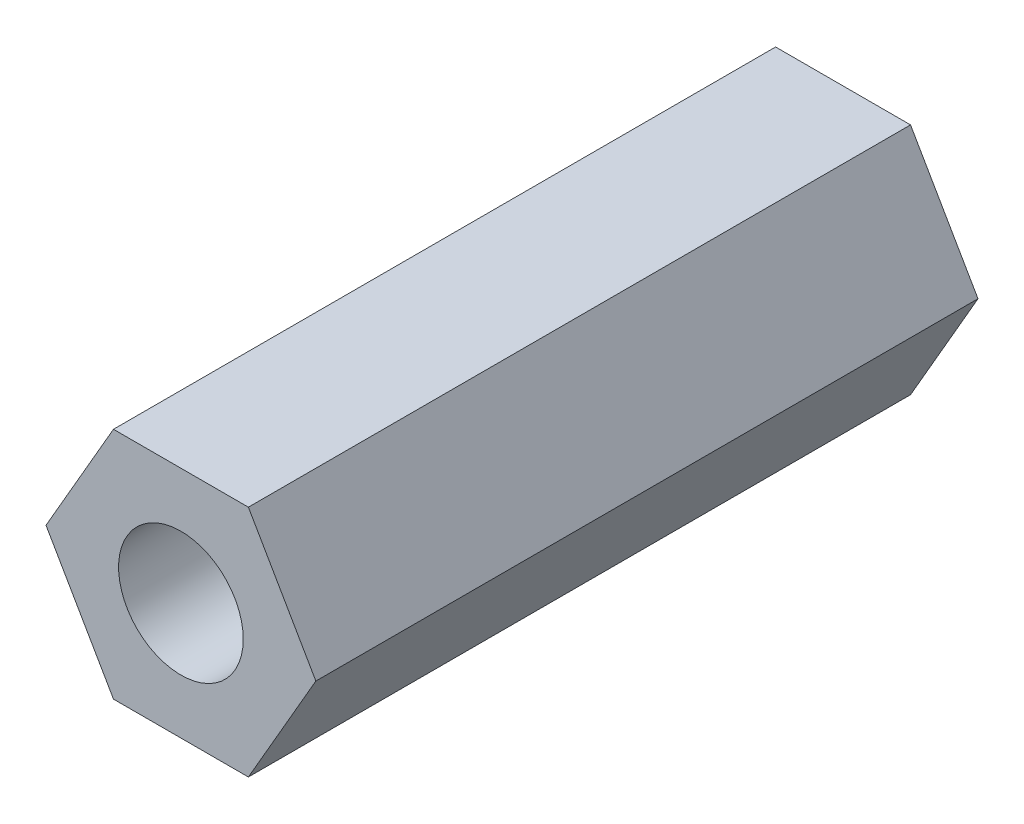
from build123d import *

# Parameters (mm, degrees)
SKETCH_1_R      = 1.6
EXTRUDE_1_DEPTH = 17


with BuildPart() as part:
    # Sketch 1 → Extrude 1 (new body)
    with BuildSketch(Plane.XY):
        Polygon((1.732050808, 3), (-1.732050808, 3), (-3.464101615, 0), (-1.732050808, -3), (1.732050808, -3), (3.464101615, 0), align=None)
        Circle(SKETCH_1_R, mode=Mode.SUBTRACT)
    extrude(amount=EXTRUDE_1_DEPTH)


solid = part.part
